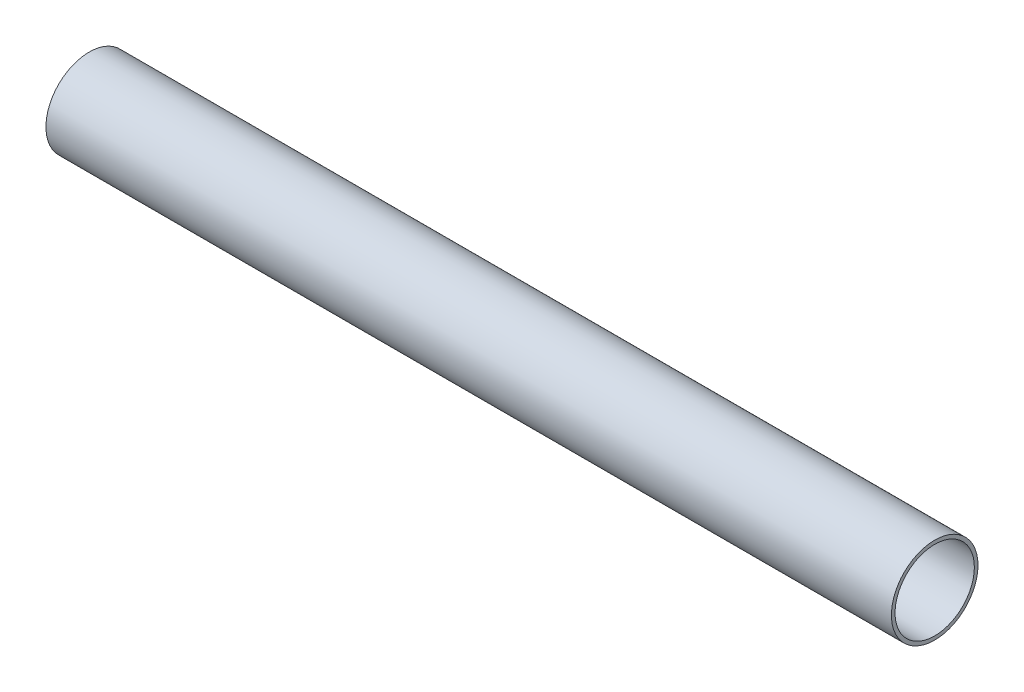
ISO-10303-21;
HEADER;
FILE_DESCRIPTION(('STEP AP214'),'2;1');
FILE_NAME('part.step','',(''),(''),'','','');
FILE_SCHEMA(('AUTOMOTIVE_DESIGN { 1 0 10303 214 1 1 1 1 }'));
ENDSEC;
DATA;
#1=APPLICATION_CONTEXT('core data for automotive mechanical design processes');
#2=APPLICATION_PROTOCOL_DEFINITION('international standard','automotive_design',2000,#1);
#3=PRODUCT_CONTEXT('',#1,'mechanical');
#4=PRODUCT('Part','Part','',(#3));
#5=PRODUCT_RELATED_PRODUCT_CATEGORY('part','',(#4));
#6=PRODUCT_DEFINITION_FORMATION('','',#4);
#7=PRODUCT_DEFINITION_CONTEXT('part definition',#1,'design');
#8=PRODUCT_DEFINITION('design','',#6,#7);
#9=PRODUCT_DEFINITION_SHAPE('','',#8);
#10=(LENGTH_UNIT() NAMED_UNIT(*) SI_UNIT(.MILLI.,.METRE.));
#11=(NAMED_UNIT(*) PLANE_ANGLE_UNIT() SI_UNIT($,.RADIAN.));
#12=(NAMED_UNIT(*) SI_UNIT($,.STERADIAN.) SOLID_ANGLE_UNIT());
#13=UNCERTAINTY_MEASURE_WITH_UNIT(LENGTH_MEASURE(1.E-05),#10,'distance_accuracy_value','');
#14=(GEOMETRIC_REPRESENTATION_CONTEXT(3) GLOBAL_UNCERTAINTY_ASSIGNED_CONTEXT((#13)) GLOBAL_UNIT_ASSIGNED_CONTEXT((#10,
#11,#12)) REPRESENTATION_CONTEXT('',''));
#15=CARTESIAN_POINT('',(0.,0.,0.));
#16=DIRECTION('',(0.,0.,1.));
#17=DIRECTION('',(1.,0.,0.));
#18=AXIS2_PLACEMENT_3D('',#15,#16,#17);
#19=CARTESIAN_POINT('',(0.,0.,0.));
#20=DIRECTION('',(1.,0.,0.));
#21=DIRECTION('',(0.,0.,-1.));
#22=AXIS2_PLACEMENT_3D('',#19,#20,#21);
#23=CYLINDRICAL_SURFACE('',#22,38.05);
#24=CARTESIAN_POINT('',(0.,0.,0.));
#25=DIRECTION('',(1.,0.,0.));
#26=DIRECTION('',(0.,0.,-1.));
#27=AXIS2_PLACEMENT_3D('',#24,#25,#26);
#28=CIRCLE('',#27,38.05);
#29=CARTESIAN_POINT('',(0.,0.,-38.05));
#30=VERTEX_POINT('',#29);
#31=EDGE_CURVE('E10',#30,#30,#28,.T.);
#32=CARTESIAN_POINT('',(743.,0.,0.));
#33=DIRECTION('',(1.,0.,0.));
#34=DIRECTION('',(0.,0.,-1.));
#35=AXIS2_PLACEMENT_3D('',#32,#33,#34);
#36=CIRCLE('',#35,38.05);
#37=CARTESIAN_POINT('',(743.,0.,-38.05));
#38=VERTEX_POINT('',#37);
#39=EDGE_CURVE('E33',#38,#38,#36,.T.);
#40=CARTESIAN_POINT('',(0.,0.,-38.05));
#41=CARTESIAN_POINT('',(7.73958333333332,0.,-38.05));
#42=CARTESIAN_POINT('',(15.4791666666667,0.,-38.05));
#43=CARTESIAN_POINT('',(30.9583333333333,0.,-38.05));
#44=CARTESIAN_POINT('',(38.6979166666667,0.,-38.05));
#45=CARTESIAN_POINT('',(54.1770833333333,0.,-38.05));
#46=CARTESIAN_POINT('',(61.9166666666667,0.,-38.05));
#47=CARTESIAN_POINT('',(77.3958333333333,0.,-38.05));
#48=CARTESIAN_POINT('',(85.1354166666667,0.,-38.05));
#49=CARTESIAN_POINT('',(100.614583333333,0.,-38.05));
#50=CARTESIAN_POINT('',(108.354166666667,0.,-38.05));
#51=CARTESIAN_POINT('',(123.833333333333,0.,-38.05));
#52=CARTESIAN_POINT('',(131.572916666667,0.,-38.05));
#53=CARTESIAN_POINT('',(147.052083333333,0.,-38.05));
#54=CARTESIAN_POINT('',(154.791666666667,0.,-38.05));
#55=CARTESIAN_POINT('',(170.270833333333,0.,-38.05));
#56=CARTESIAN_POINT('',(178.010416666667,0.,-38.05));
#57=CARTESIAN_POINT('',(193.489583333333,0.,-38.05));
#58=CARTESIAN_POINT('',(201.229166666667,0.,-38.05));
#59=CARTESIAN_POINT('',(216.708333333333,0.,-38.05));
#60=CARTESIAN_POINT('',(224.447916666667,0.,-38.05));
#61=CARTESIAN_POINT('',(239.927083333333,0.,-38.05));
#62=CARTESIAN_POINT('',(247.666666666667,0.,-38.05));
#63=CARTESIAN_POINT('',(263.145833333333,0.,-38.05));
#64=CARTESIAN_POINT('',(270.885416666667,0.,-38.05));
#65=CARTESIAN_POINT('',(286.364583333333,0.,-38.05));
#66=CARTESIAN_POINT('',(294.104166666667,0.,-38.05));
#67=CARTESIAN_POINT('',(309.583333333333,0.,-38.05));
#68=CARTESIAN_POINT('',(317.322916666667,0.,-38.05));
#69=CARTESIAN_POINT('',(332.802083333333,0.,-38.05));
#70=CARTESIAN_POINT('',(340.541666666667,0.,-38.05));
#71=CARTESIAN_POINT('',(356.020833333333,0.,-38.05));
#72=CARTESIAN_POINT('',(363.760416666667,0.,-38.05));
#73=CARTESIAN_POINT('',(379.239583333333,0.,-38.05));
#74=CARTESIAN_POINT('',(386.979166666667,0.,-38.05));
#75=CARTESIAN_POINT('',(402.458333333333,0.,-38.05));
#76=CARTESIAN_POINT('',(410.197916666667,0.,-38.05));
#77=CARTESIAN_POINT('',(425.677083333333,0.,-38.05));
#78=CARTESIAN_POINT('',(433.416666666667,0.,-38.05));
#79=CARTESIAN_POINT('',(448.895833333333,0.,-38.05));
#80=CARTESIAN_POINT('',(456.635416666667,0.,-38.05));
#81=CARTESIAN_POINT('',(472.114583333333,0.,-38.05));
#82=CARTESIAN_POINT('',(479.854166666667,0.,-38.05));
#83=CARTESIAN_POINT('',(495.333333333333,0.,-38.05));
#84=CARTESIAN_POINT('',(503.072916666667,0.,-38.05));
#85=CARTESIAN_POINT('',(518.552083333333,0.,-38.05));
#86=CARTESIAN_POINT('',(526.291666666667,0.,-38.05));
#87=CARTESIAN_POINT('',(541.770833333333,0.,-38.05));
#88=CARTESIAN_POINT('',(549.510416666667,0.,-38.05));
#89=CARTESIAN_POINT('',(564.989583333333,0.,-38.05));
#90=CARTESIAN_POINT('',(572.729166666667,0.,-38.05));
#91=CARTESIAN_POINT('',(588.208333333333,0.,-38.05));
#92=CARTESIAN_POINT('',(595.947916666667,0.,-38.05));
#93=CARTESIAN_POINT('',(611.427083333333,0.,-38.05));
#94=CARTESIAN_POINT('',(619.166666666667,0.,-38.05));
#95=CARTESIAN_POINT('',(634.645833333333,0.,-38.05));
#96=CARTESIAN_POINT('',(642.385416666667,0.,-38.05));
#97=CARTESIAN_POINT('',(657.864583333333,0.,-38.05));
#98=CARTESIAN_POINT('',(665.604166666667,0.,-38.05));
#99=CARTESIAN_POINT('',(681.083333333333,0.,-38.05));
#100=CARTESIAN_POINT('',(688.822916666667,0.,-38.05));
#101=CARTESIAN_POINT('',(704.302083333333,0.,-38.05));
#102=CARTESIAN_POINT('',(712.041666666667,0.,-38.05));
#103=CARTESIAN_POINT('',(727.520833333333,0.,-38.05));
#104=CARTESIAN_POINT('',(735.260416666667,0.,-38.05));
#105=CARTESIAN_POINT('',(743.,0.,-38.05));
#106=B_SPLINE_CURVE_WITH_KNOTS('',3,(#40,#41,#42,#43,#44,#45,#46,#47,#48,#49,#50,#51,#52,#53,
#54,#55,#56,#57,#58,#59,#60,#61,#62,#63,#64,#65,#66,#67,#68,#69,#70,#71,#72,#73,#74,#75,#76,#77,
#78,#79,#80,#81,#82,#83,#84,#85,#86,#87,#88,#89,#90,#91,#92,#93,#94,#95,#96,#97,#98,#99,#100,
#101,#102,#103,#104,#105),.UNSPECIFIED.,.F.,.F.,(4,2,2,2,2,2,2,2,2,2,2,2,2,2,2,2,2,2,2,2,2,2,2,
2,2,2,2,2,2,2,2,2,4),(0.,23.21875,46.4375,69.65625,92.875,116.09375,139.3125,162.53125,185.75,
208.96875,232.1875,255.40625,278.625,301.84375,325.0625,348.28125,371.5,394.71875,417.9375,
441.15625,464.375,487.59375,510.8125,534.03125,557.25,580.46875,603.6875,626.90625,650.125,
673.34375,696.5625,719.78125,743.),.UNSPECIFIED.);
#107=EDGE_CURVE('BSEAM30',#30,#38,#106,.T.);
#108=ORIENTED_EDGE('',*,*,#31,.T.);
#109=ORIENTED_EDGE('',*,*,#39,.F.);
#110=ORIENTED_EDGE('',*,*,#107,.T.);
#111=ORIENTED_EDGE('',*,*,#107,.F.);
#112=EDGE_LOOP('',(#108,#110,#109,#111));
#113=FACE_BOUND('',#112,.T.);
#114=ADVANCED_FACE('F30',(#113),#23,.T.);
#115=CARTESIAN_POINT('',(0.,0.,0.));
#116=DIRECTION('',(1.,0.,0.));
#117=DIRECTION('',(0.,0.,-1.));
#118=AXIS2_PLACEMENT_3D('',#115,#116,#117);
#119=PLANE('',#118);
#120=CARTESIAN_POINT('',(0.,0.,0.));
#121=DIRECTION('',(1.,0.,0.));
#122=DIRECTION('',(0.,0.,-1.));
#123=AXIS2_PLACEMENT_3D('',#120,#121,#122);
#124=CIRCLE('',#123,34.85);
#125=CARTESIAN_POINT('',(0.,0.,-34.85));
#126=VERTEX_POINT('',#125);
#127=EDGE_CURVE('E40',#126,#126,#124,.T.);
#128=ORIENTED_EDGE('',*,*,#127,.T.);
#129=EDGE_LOOP('',(#128));
#130=FACE_BOUND('',#129,.T.);
#131=ORIENTED_EDGE('',*,*,#31,.F.);
#132=EDGE_LOOP('',(#131));
#133=FACE_BOUND('',#132,.T.);
#134=ADVANCED_FACE('F48',(#130,#133),#119,.F.);
#135=CARTESIAN_POINT('',(743.,0.,0.));
#136=DIRECTION('',(1.,0.,0.));
#137=DIRECTION('',(0.,0.,-1.));
#138=AXIS2_PLACEMENT_3D('',#135,#136,#137);
#139=PLANE('',#138);
#140=CARTESIAN_POINT('',(743.,0.,0.));
#141=DIRECTION('',(1.,0.,0.));
#142=DIRECTION('',(0.,0.,-1.));
#143=AXIS2_PLACEMENT_3D('',#140,#141,#142);
#144=CIRCLE('',#143,34.85);
#145=CARTESIAN_POINT('',(743.,0.,-34.85));
#146=VERTEX_POINT('',#145);
#147=EDGE_CURVE('E42',#146,#146,#144,.T.);
#148=ORIENTED_EDGE('',*,*,#147,.F.);
#149=EDGE_LOOP('',(#148));
#150=FACE_BOUND('',#149,.T.);
#151=ORIENTED_EDGE('',*,*,#39,.T.);
#152=EDGE_LOOP('',(#151));
#153=FACE_BOUND('',#152,.T.);
#154=ADVANCED_FACE('F54',(#150,#153),#139,.T.);
#155=CARTESIAN_POINT('',(0.,0.,0.));
#156=DIRECTION('',(1.,0.,0.));
#157=DIRECTION('',(0.,0.,-1.));
#158=AXIS2_PLACEMENT_3D('',#155,#156,#157);
#159=CYLINDRICAL_SURFACE('',#158,34.85);
#160=CARTESIAN_POINT('',(0.,0.,-34.85));
#161=CARTESIAN_POINT('',(7.73958333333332,0.,-34.85));
#162=CARTESIAN_POINT('',(15.4791666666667,0.,-34.85));
#163=CARTESIAN_POINT('',(30.9583333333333,0.,-34.85));
#164=CARTESIAN_POINT('',(38.6979166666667,0.,-34.85));
#165=CARTESIAN_POINT('',(54.1770833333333,0.,-34.85));
#166=CARTESIAN_POINT('',(61.9166666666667,0.,-34.85));
#167=CARTESIAN_POINT('',(77.3958333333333,0.,-34.85));
#168=CARTESIAN_POINT('',(85.1354166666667,0.,-34.85));
#169=CARTESIAN_POINT('',(100.614583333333,0.,-34.85));
#170=CARTESIAN_POINT('',(108.354166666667,0.,-34.85));
#171=CARTESIAN_POINT('',(123.833333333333,0.,-34.85));
#172=CARTESIAN_POINT('',(131.572916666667,0.,-34.85));
#173=CARTESIAN_POINT('',(147.052083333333,0.,-34.85));
#174=CARTESIAN_POINT('',(154.791666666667,0.,-34.85));
#175=CARTESIAN_POINT('',(170.270833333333,0.,-34.85));
#176=CARTESIAN_POINT('',(178.010416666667,0.,-34.85));
#177=CARTESIAN_POINT('',(193.489583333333,0.,-34.85));
#178=CARTESIAN_POINT('',(201.229166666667,0.,-34.85));
#179=CARTESIAN_POINT('',(216.708333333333,0.,-34.85));
#180=CARTESIAN_POINT('',(224.447916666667,0.,-34.85));
#181=CARTESIAN_POINT('',(239.927083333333,0.,-34.85));
#182=CARTESIAN_POINT('',(247.666666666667,0.,-34.85));
#183=CARTESIAN_POINT('',(263.145833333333,0.,-34.85));
#184=CARTESIAN_POINT('',(270.885416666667,0.,-34.85));
#185=CARTESIAN_POINT('',(286.364583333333,0.,-34.85));
#186=CARTESIAN_POINT('',(294.104166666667,0.,-34.85));
#187=CARTESIAN_POINT('',(309.583333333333,0.,-34.85));
#188=CARTESIAN_POINT('',(317.322916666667,0.,-34.85));
#189=CARTESIAN_POINT('',(332.802083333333,0.,-34.85));
#190=CARTESIAN_POINT('',(340.541666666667,0.,-34.85));
#191=CARTESIAN_POINT('',(356.020833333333,0.,-34.85));
#192=CARTESIAN_POINT('',(363.760416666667,0.,-34.85));
#193=CARTESIAN_POINT('',(379.239583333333,0.,-34.85));
#194=CARTESIAN_POINT('',(386.979166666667,0.,-34.85));
#195=CARTESIAN_POINT('',(402.458333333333,0.,-34.85));
#196=CARTESIAN_POINT('',(410.197916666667,0.,-34.85));
#197=CARTESIAN_POINT('',(425.677083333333,0.,-34.85));
#198=CARTESIAN_POINT('',(433.416666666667,0.,-34.85));
#199=CARTESIAN_POINT('',(448.895833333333,0.,-34.85));
#200=CARTESIAN_POINT('',(456.635416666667,0.,-34.85));
#201=CARTESIAN_POINT('',(472.114583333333,0.,-34.85));
#202=CARTESIAN_POINT('',(479.854166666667,0.,-34.85));
#203=CARTESIAN_POINT('',(495.333333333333,0.,-34.85));
#204=CARTESIAN_POINT('',(503.072916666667,0.,-34.85));
#205=CARTESIAN_POINT('',(518.552083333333,0.,-34.85));
#206=CARTESIAN_POINT('',(526.291666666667,0.,-34.85));
#207=CARTESIAN_POINT('',(541.770833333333,0.,-34.85));
#208=CARTESIAN_POINT('',(549.510416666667,0.,-34.85));
#209=CARTESIAN_POINT('',(564.989583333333,0.,-34.85));
#210=CARTESIAN_POINT('',(572.729166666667,0.,-34.85));
#211=CARTESIAN_POINT('',(588.208333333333,0.,-34.85));
#212=CARTESIAN_POINT('',(595.947916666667,0.,-34.85));
#213=CARTESIAN_POINT('',(611.427083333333,0.,-34.85));
#214=CARTESIAN_POINT('',(619.166666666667,0.,-34.85));
#215=CARTESIAN_POINT('',(634.645833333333,0.,-34.85));
#216=CARTESIAN_POINT('',(642.385416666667,0.,-34.85));
#217=CARTESIAN_POINT('',(657.864583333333,0.,-34.85));
#218=CARTESIAN_POINT('',(665.604166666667,0.,-34.85));
#219=CARTESIAN_POINT('',(681.083333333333,0.,-34.85));
#220=CARTESIAN_POINT('',(688.822916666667,0.,-34.85));
#221=CARTESIAN_POINT('',(704.302083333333,0.,-34.85));
#222=CARTESIAN_POINT('',(712.041666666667,0.,-34.85));
#223=CARTESIAN_POINT('',(727.520833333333,0.,-34.85));
#224=CARTESIAN_POINT('',(735.260416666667,0.,-34.85));
#225=CARTESIAN_POINT('',(743.,0.,-34.85));
#226=B_SPLINE_CURVE_WITH_KNOTS('',3,(#160,#161,#162,#163,#164,#165,#166,#167,#168,#169,#170,
#171,#172,#173,#174,#175,#176,#177,#178,#179,#180,#181,#182,#183,#184,#185,#186,#187,#188,#189,
#190,#191,#192,#193,#194,#195,#196,#197,#198,#199,#200,#201,#202,#203,#204,#205,#206,#207,#208,
#209,#210,#211,#212,#213,#214,#215,#216,#217,#218,#219,#220,#221,#222,#223,#224,#225),
.UNSPECIFIED.,.F.,.F.,(4,2,2,2,2,2,2,2,2,2,2,2,2,2,2,2,2,2,2,2,2,2,2,2,2,2,2,2,2,2,2,2,4),(0.,
23.21875,46.4375,69.65625,92.875,116.09375,139.3125,162.53125,185.75,208.96875,232.1875,
255.40625,278.625,301.84375,325.0625,348.28125,371.5,394.71875,417.9375,441.15625,464.375,
487.59375,510.8125,534.03125,557.25,580.46875,603.6875,626.90625,650.125,673.34375,696.5625,
719.78125,743.),.UNSPECIFIED.);
#227=EDGE_CURVE('BSEAM51',#126,#146,#226,.T.);
#228=ORIENTED_EDGE('',*,*,#127,.F.);
#229=ORIENTED_EDGE('',*,*,#147,.T.);
#230=ORIENTED_EDGE('',*,*,#227,.T.);
#231=ORIENTED_EDGE('',*,*,#227,.F.);
#232=EDGE_LOOP('',(#228,#230,#229,#231));
#233=FACE_BOUND('',#232,.T.);
#234=ADVANCED_FACE('F51',(#233),#159,.F.);
#235=CLOSED_SHELL('',(#114,#134,#154,#234));
#236=MANIFOLD_SOLID_BREP('B2',#235);
#237=ADVANCED_BREP_SHAPE_REPRESENTATION('',(#18,#236),#14);
#238=SHAPE_DEFINITION_REPRESENTATION(#9,#237);
ENDSEC;
END-ISO-10303-21;
